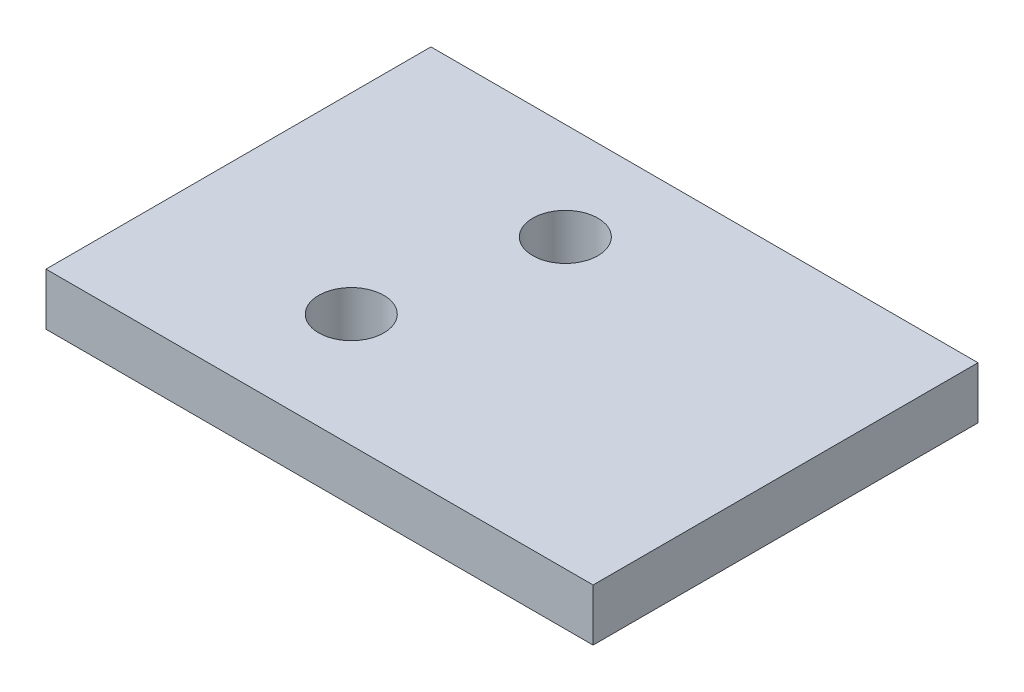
ISO-10303-21;
HEADER;
FILE_DESCRIPTION(('STEP AP214'),'2;1');
FILE_NAME('part.step','',(''),(''),'','','');
FILE_SCHEMA(('AUTOMOTIVE_DESIGN { 1 0 10303 214 1 1 1 1 }'));
ENDSEC;
DATA;
#1=APPLICATION_CONTEXT('core data for automotive mechanical design processes');
#2=APPLICATION_PROTOCOL_DEFINITION('international standard','automotive_design',2000,#1);
#3=PRODUCT_CONTEXT('',#1,'mechanical');
#4=PRODUCT('Part','Part','',(#3));
#5=PRODUCT_RELATED_PRODUCT_CATEGORY('part','',(#4));
#6=PRODUCT_DEFINITION_FORMATION('','',#4);
#7=PRODUCT_DEFINITION_CONTEXT('part definition',#1,'design');
#8=PRODUCT_DEFINITION('design','',#6,#7);
#9=PRODUCT_DEFINITION_SHAPE('','',#8);
#10=(LENGTH_UNIT() NAMED_UNIT(*) SI_UNIT(.MILLI.,.METRE.));
#11=(NAMED_UNIT(*) PLANE_ANGLE_UNIT() SI_UNIT($,.RADIAN.));
#12=(NAMED_UNIT(*) SI_UNIT($,.STERADIAN.) SOLID_ANGLE_UNIT());
#13=UNCERTAINTY_MEASURE_WITH_UNIT(LENGTH_MEASURE(1.E-05),#10,'distance_accuracy_value','');
#14=(GEOMETRIC_REPRESENTATION_CONTEXT(3) GLOBAL_UNCERTAINTY_ASSIGNED_CONTEXT((#13)) GLOBAL_UNIT_ASSIGNED_CONTEXT((#10,
#11,#12)) REPRESENTATION_CONTEXT('',''));
#15=CARTESIAN_POINT('',(0.,0.,0.));
#16=DIRECTION('',(0.,0.,1.));
#17=DIRECTION('',(1.,0.,0.));
#18=AXIS2_PLACEMENT_3D('',#15,#16,#17);
#19=CARTESIAN_POINT('',(0.,203.2,0.));
#20=DIRECTION('',(1.,0.,0.));
#21=DIRECTION('',(0.,0.,-1.));
#22=AXIS2_PLACEMENT_3D('',#19,#20,#21);
#23=PLANE('',#22);
#24=DIRECTION('',(0.,0.,1.));
#25=VECTOR('',#24,1.);
#26=CARTESIAN_POINT('',(0.,0.,0.));
#27=LINE('',#26,#25);
#28=CARTESIAN_POINT('',(0.,0.,-1501.14));
#29=VERTEX_POINT('',#28);
#30=CARTESIAN_POINT('',(0.,0.,0.));
#31=VERTEX_POINT('',#30);
#32=EDGE_CURVE('E101',#29,#31,#27,.T.);
#33=ORIENTED_EDGE('',*,*,#32,.T.);
#34=DIRECTION('',(0.,-1.,0.));
#35=VECTOR('',#34,1.);
#36=CARTESIAN_POINT('',(0.,203.2,0.));
#37=LINE('',#36,#35);
#38=CARTESIAN_POINT('',(0.,203.2,0.));
#39=VERTEX_POINT('',#38);
#40=EDGE_CURVE('E11',#39,#31,#37,.T.);
#41=ORIENTED_EDGE('',*,*,#40,.F.);
#42=DIRECTION('',(0.,0.,1.));
#43=VECTOR('',#42,1.);
#44=CARTESIAN_POINT('',(0.,203.2,0.));
#45=LINE('',#44,#43);
#46=CARTESIAN_POINT('',(0.,203.2,-1501.14));
#47=VERTEX_POINT('',#46);
#48=EDGE_CURVE('E89',#47,#39,#45,.T.);
#49=ORIENTED_EDGE('',*,*,#48,.F.);
#50=DIRECTION('',(0.,-1.,0.));
#51=VECTOR('',#50,1.);
#52=CARTESIAN_POINT('',(0.,203.2,-1501.14));
#53=LINE('',#52,#51);
#54=EDGE_CURVE('E97',#47,#29,#53,.T.);
#55=ORIENTED_EDGE('',*,*,#54,.T.);
#56=EDGE_LOOP('',(#33,#41,#49,#55));
#57=FACE_BOUND('',#56,.T.);
#58=ADVANCED_FACE('F38',(#57),#23,.F.);
#59=CARTESIAN_POINT('',(0.,203.2,0.));
#60=DIRECTION('',(0.,0.,-1.));
#61=DIRECTION('',(-1.,0.,0.));
#62=AXIS2_PLACEMENT_3D('',#59,#60,#61);
#63=PLANE('',#62);
#64=DIRECTION('',(1.,0.,0.));
#65=VECTOR('',#64,1.);
#66=CARTESIAN_POINT('',(0.,0.,0.));
#67=LINE('',#66,#65);
#68=CARTESIAN_POINT('',(2133.6,0.,0.));
#69=VERTEX_POINT('',#68);
#70=EDGE_CURVE('E93',#31,#69,#67,.T.);
#71=ORIENTED_EDGE('',*,*,#70,.T.);
#72=DIRECTION('',(0.,-1.,0.));
#73=VECTOR('',#72,1.);
#74=CARTESIAN_POINT('',(2133.6,203.2,0.));
#75=LINE('',#74,#73);
#76=CARTESIAN_POINT('',(2133.6,203.2,0.));
#77=VERTEX_POINT('',#76);
#78=EDGE_CURVE('E46',#77,#69,#75,.T.);
#79=ORIENTED_EDGE('',*,*,#78,.F.);
#80=DIRECTION('',(1.,0.,0.));
#81=VECTOR('',#80,1.);
#82=CARTESIAN_POINT('',(0.,203.2,0.));
#83=LINE('',#82,#81);
#84=EDGE_CURVE('E84',#39,#77,#83,.T.);
#85=ORIENTED_EDGE('',*,*,#84,.F.);
#86=ORIENTED_EDGE('',*,*,#40,.T.);
#87=EDGE_LOOP('',(#71,#79,#85,#86));
#88=FACE_BOUND('',#87,.T.);
#89=ADVANCED_FACE('F92',(#88),#63,.F.);
#90=CARTESIAN_POINT('',(2133.6,203.2,0.));
#91=DIRECTION('',(-1.,0.,0.));
#92=DIRECTION('',(0.,0.,1.));
#93=AXIS2_PLACEMENT_3D('',#90,#91,#92);
#94=PLANE('',#93);
#95=DIRECTION('',(0.,0.,-1.));
#96=VECTOR('',#95,1.);
#97=CARTESIAN_POINT('',(2133.6,0.,0.));
#98=LINE('',#97,#96);
#99=CARTESIAN_POINT('',(2133.6,0.,-1501.14));
#100=VERTEX_POINT('',#99);
#101=EDGE_CURVE('E71',#69,#100,#98,.T.);
#102=ORIENTED_EDGE('',*,*,#101,.T.);
#103=DIRECTION('',(0.,-1.,0.));
#104=VECTOR('',#103,1.);
#105=CARTESIAN_POINT('',(2133.6,203.2,-1501.14));
#106=LINE('',#105,#104);
#107=CARTESIAN_POINT('',(2133.6,203.2,-1501.14));
#108=VERTEX_POINT('',#107);
#109=EDGE_CURVE('E94',#108,#100,#106,.T.);
#110=ORIENTED_EDGE('',*,*,#109,.F.);
#111=DIRECTION('',(0.,0.,-1.));
#112=VECTOR('',#111,1.);
#113=CARTESIAN_POINT('',(2133.6,203.2,0.));
#114=LINE('',#113,#112);
#115=EDGE_CURVE('E87',#77,#108,#114,.T.);
#116=ORIENTED_EDGE('',*,*,#115,.F.);
#117=ORIENTED_EDGE('',*,*,#78,.T.);
#118=EDGE_LOOP('',(#102,#110,#116,#117));
#119=FACE_BOUND('',#118,.T.);
#120=ADVANCED_FACE('F95',(#119),#94,.F.);
#121=CARTESIAN_POINT('',(0.,203.2,-1501.14));
#122=DIRECTION('',(0.,0.,1.));
#123=DIRECTION('',(1.,0.,0.));
#124=AXIS2_PLACEMENT_3D('',#121,#122,#123);
#125=PLANE('',#124);
#126=DIRECTION('',(-1.,0.,0.));
#127=VECTOR('',#126,1.);
#128=CARTESIAN_POINT('',(0.,0.,-1501.14));
#129=LINE('',#128,#127);
#130=EDGE_CURVE('E77',#100,#29,#129,.T.);
#131=ORIENTED_EDGE('',*,*,#130,.T.);
#132=ORIENTED_EDGE('',*,*,#54,.F.);
#133=DIRECTION('',(-1.,0.,0.));
#134=VECTOR('',#133,1.);
#135=CARTESIAN_POINT('',(0.,203.2,-1501.14));
#136=LINE('',#135,#134);
#137=EDGE_CURVE('E54',#108,#47,#136,.T.);
#138=ORIENTED_EDGE('',*,*,#137,.F.);
#139=ORIENTED_EDGE('',*,*,#109,.T.);
#140=EDGE_LOOP('',(#131,#132,#138,#139));
#141=FACE_BOUND('',#140,.T.);
#142=ADVANCED_FACE('F110',(#141),#125,.F.);
#143=CARTESIAN_POINT('',(0.,203.2,-1501.14));
#144=DIRECTION('',(0.,-1.,0.));
#145=DIRECTION('',(0.,0.,-1.));
#146=AXIS2_PLACEMENT_3D('',#143,#144,#145);
#147=PLANE('',#146);
#148=CARTESIAN_POINT('',(747.3,203.2,-443.2));
#149=DIRECTION('',(0.,1.,0.));
#150=DIRECTION('',(0.,0.,1.));
#151=AXIS2_PLACEMENT_3D('',#148,#149,#150);
#152=CIRCLE('',#151,127.);
#153=CARTESIAN_POINT('',(747.3,203.2,-316.2));
#154=VERTEX_POINT('',#153);
#155=EDGE_CURVE('E122',#154,#154,#152,.T.);
#156=ORIENTED_EDGE('',*,*,#155,.F.);
#157=EDGE_LOOP('',(#156));
#158=FACE_BOUND('',#157,.T.);
#159=CARTESIAN_POINT('',(904.,203.2,-1121.4));
#160=DIRECTION('',(0.,1.,0.));
#161=DIRECTION('',(0.,0.,1.));
#162=AXIS2_PLACEMENT_3D('',#159,#160,#161);
#163=CIRCLE('',#162,127.);
#164=CARTESIAN_POINT('',(904.,203.2,-994.4));
#165=VERTEX_POINT('',#164);
#166=EDGE_CURVE('E116',#165,#165,#163,.T.);
#167=ORIENTED_EDGE('',*,*,#166,.F.);
#168=EDGE_LOOP('',(#167));
#169=FACE_BOUND('',#168,.T.);
#170=ORIENTED_EDGE('',*,*,#48,.T.);
#171=ORIENTED_EDGE('',*,*,#84,.T.);
#172=ORIENTED_EDGE('',*,*,#115,.T.);
#173=ORIENTED_EDGE('',*,*,#137,.T.);
#174=EDGE_LOOP('',(#170,#171,#172,#173));
#175=FACE_BOUND('',#174,.T.);
#176=ADVANCED_FACE('F85',(#158,#169,#175),#147,.F.);
#177=CARTESIAN_POINT('',(0.,0.,-1501.14));
#178=DIRECTION('',(0.,-1.,0.));
#179=DIRECTION('',(0.,0.,-1.));
#180=AXIS2_PLACEMENT_3D('',#177,#178,#179);
#181=PLANE('',#180);
#182=CARTESIAN_POINT('',(747.3,0.,-443.2));
#183=DIRECTION('',(0.,1.,0.));
#184=DIRECTION('',(0.,0.,1.));
#185=AXIS2_PLACEMENT_3D('',#182,#183,#184);
#186=CIRCLE('',#185,127.);
#187=CARTESIAN_POINT('',(747.3,0.,-316.2));
#188=VERTEX_POINT('',#187);
#189=EDGE_CURVE('E119',#188,#188,#186,.T.);
#190=ORIENTED_EDGE('',*,*,#189,.T.);
#191=EDGE_LOOP('',(#190));
#192=FACE_BOUND('',#191,.T.);
#193=CARTESIAN_POINT('',(904.,0.,-1121.4));
#194=DIRECTION('',(0.,1.,0.));
#195=DIRECTION('',(0.,0.,1.));
#196=AXIS2_PLACEMENT_3D('',#193,#194,#195);
#197=CIRCLE('',#196,127.);
#198=CARTESIAN_POINT('',(904.,0.,-994.4));
#199=VERTEX_POINT('',#198);
#200=EDGE_CURVE('E104',#199,#199,#197,.T.);
#201=ORIENTED_EDGE('',*,*,#200,.T.);
#202=EDGE_LOOP('',(#201));
#203=FACE_BOUND('',#202,.T.);
#204=ORIENTED_EDGE('',*,*,#32,.F.);
#205=ORIENTED_EDGE('',*,*,#130,.F.);
#206=ORIENTED_EDGE('',*,*,#101,.F.);
#207=ORIENTED_EDGE('',*,*,#70,.F.);
#208=EDGE_LOOP('',(#204,#205,#206,#207));
#209=FACE_BOUND('',#208,.T.);
#210=ADVANCED_FACE('F113',(#192,#203,#209),#181,.T.);
#211=CARTESIAN_POINT('',(904.,0.,-1121.4));
#212=DIRECTION('',(0.,1.,0.));
#213=DIRECTION('',(0.,0.,1.));
#214=AXIS2_PLACEMENT_3D('',#211,#212,#213);
#215=CYLINDRICAL_SURFACE('',#214,127.);
#216=ORIENTED_EDGE('',*,*,#200,.F.);
#217=EDGE_LOOP('',(#216));
#218=FACE_BOUND('',#217,.T.);
#219=ORIENTED_EDGE('',*,*,#166,.T.);
#220=EDGE_LOOP('',(#219));
#221=FACE_BOUND('',#220,.T.);
#222=ADVANCED_FACE('F133',(#218,#221),#215,.F.);
#223=CARTESIAN_POINT('',(747.3,0.,-443.2));
#224=DIRECTION('',(0.,1.,0.));
#225=DIRECTION('',(0.,0.,1.));
#226=AXIS2_PLACEMENT_3D('',#223,#224,#225);
#227=CYLINDRICAL_SURFACE('',#226,127.);
#228=ORIENTED_EDGE('',*,*,#189,.F.);
#229=EDGE_LOOP('',(#228));
#230=FACE_BOUND('',#229,.T.);
#231=ORIENTED_EDGE('',*,*,#155,.T.);
#232=EDGE_LOOP('',(#231));
#233=FACE_BOUND('',#232,.T.);
#234=ADVANCED_FACE('F130',(#230,#233),#227,.F.);
#235=CLOSED_SHELL('',(#58,#89,#120,#142,#176,#210,#222,#234));
#236=MANIFOLD_SOLID_BREP('B2',#235);
#237=ADVANCED_BREP_SHAPE_REPRESENTATION('',(#18,#236),#14);
#238=SHAPE_DEFINITION_REPRESENTATION(#9,#237);
ENDSEC;
END-ISO-10303-21;
